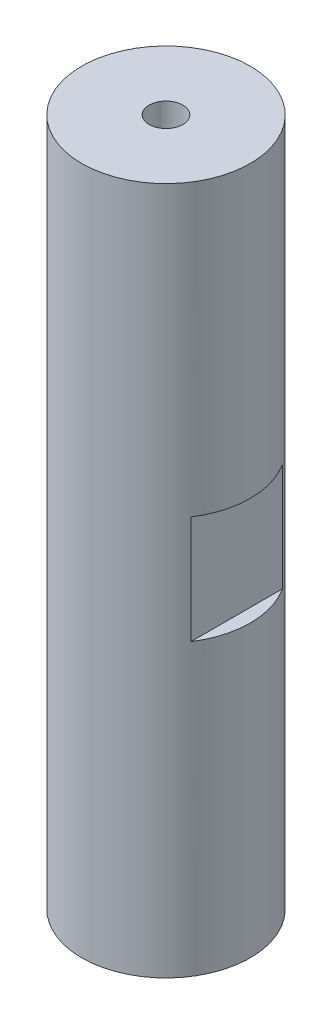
ISO-10303-21;
HEADER;
FILE_DESCRIPTION(('STEP AP214'),'2;1');
FILE_NAME('part.step','',(''),(''),'','','');
FILE_SCHEMA(('AUTOMOTIVE_DESIGN { 1 0 10303 214 1 1 1 1 }'));
ENDSEC;
DATA;
#1=APPLICATION_CONTEXT('core data for automotive mechanical design processes');
#2=APPLICATION_PROTOCOL_DEFINITION('international standard','automotive_design',2000,#1);
#3=PRODUCT_CONTEXT('',#1,'mechanical');
#4=PRODUCT('Part','Part','',(#3));
#5=PRODUCT_RELATED_PRODUCT_CATEGORY('part','',(#4));
#6=PRODUCT_DEFINITION_FORMATION('','',#4);
#7=PRODUCT_DEFINITION_CONTEXT('part definition',#1,'design');
#8=PRODUCT_DEFINITION('design','',#6,#7);
#9=PRODUCT_DEFINITION_SHAPE('','',#8);
#10=(LENGTH_UNIT() NAMED_UNIT(*) SI_UNIT(.MILLI.,.METRE.));
#11=(NAMED_UNIT(*) PLANE_ANGLE_UNIT() SI_UNIT($,.RADIAN.));
#12=(NAMED_UNIT(*) SI_UNIT($,.STERADIAN.) SOLID_ANGLE_UNIT());
#13=UNCERTAINTY_MEASURE_WITH_UNIT(LENGTH_MEASURE(1.E-05),#10,'distance_accuracy_value','');
#14=(GEOMETRIC_REPRESENTATION_CONTEXT(3) GLOBAL_UNCERTAINTY_ASSIGNED_CONTEXT((#13)) GLOBAL_UNIT_ASSIGNED_CONTEXT((#10,
#11,#12)) REPRESENTATION_CONTEXT('',''));
#15=CARTESIAN_POINT('',(0.,0.,0.));
#16=DIRECTION('',(0.,0.,1.));
#17=DIRECTION('',(1.,0.,0.));
#18=AXIS2_PLACEMENT_3D('',#15,#16,#17);
#19=CARTESIAN_POINT('',(0.,86.9999999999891,0.));
#20=DIRECTION('',(0.,1.,0.));
#21=DIRECTION('',(0.,0.,1.));
#22=AXIS2_PLACEMENT_3D('',#19,#20,#21);
#23=CONICAL_SURFACE('',#22,2.49999999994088,1.02974425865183);
#24=CARTESIAN_POINT('',(0.,85.4978484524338,2.8421709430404E-11));
#25=VERTEX_POINT('',#24);
#26=VERTEX_LOOP('',#25);
#27=FACE_BOUND('',#26,.T.);
#28=CARTESIAN_POINT('',(0.,87.,0.));
#29=DIRECTION('',(0.,1.,0.));
#30=DIRECTION('',(0.,0.,1.));
#31=AXIS2_PLACEMENT_3D('',#28,#29,#30);
#32=CIRCLE('',#31,2.5);
#33=CARTESIAN_POINT('',(0.,87.,2.5));
#34=VERTEX_POINT('',#33);
#35=EDGE_CURVE('E106',#34,#34,#32,.T.);
#36=ORIENTED_EDGE('',*,*,#35,.T.);
#37=EDGE_LOOP('',(#36));
#38=FACE_BOUND('',#37,.T.);
#39=ADVANCED_FACE('F17',(#27,#38),#23,.F.);
#40=CARTESIAN_POINT('',(0.,14.9999999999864,0.));
#41=DIRECTION('',(0.,-1.,0.));
#42=DIRECTION('',(0.,0.,-1.));
#43=AXIS2_PLACEMENT_3D('',#40,#41,#42);
#44=CONICAL_SURFACE('',#43,2.49999999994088,1.02974425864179);
#45=CARTESIAN_POINT('',(0.,16.5021515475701,0.));
#46=VERTEX_POINT('',#45);
#47=VERTEX_LOOP('',#46);
#48=FACE_BOUND('',#47,.T.);
#49=CARTESIAN_POINT('',(0.,15.,0.));
#50=DIRECTION('',(0.,-1.,0.));
#51=DIRECTION('',(0.,0.,-1.));
#52=AXIS2_PLACEMENT_3D('',#49,#50,#51);
#53=CIRCLE('',#52,2.49999999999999);
#54=CARTESIAN_POINT('',(0.,15.,-2.49999999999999));
#55=VERTEX_POINT('',#54);
#56=EDGE_CURVE('E67',#55,#55,#53,.T.);
#57=ORIENTED_EDGE('',*,*,#56,.T.);
#58=EDGE_LOOP('',(#57));
#59=FACE_BOUND('',#58,.T.);
#60=ADVANCED_FACE('F223',(#48,#59),#44,.F.);
#61=CARTESIAN_POINT('',(0.,102.,0.));
#62=DIRECTION('',(0.,1.,0.));
#63=DIRECTION('',(0.,0.,1.));
#64=AXIS2_PLACEMENT_3D('',#61,#62,#63);
#65=CYLINDRICAL_SURFACE('',#64,2.5);
#66=CARTESIAN_POINT('',(0.,102.,0.));
#67=DIRECTION('',(0.,1.,0.));
#68=DIRECTION('',(0.,0.,1.));
#69=AXIS2_PLACEMENT_3D('',#66,#67,#68);
#70=CIRCLE('',#69,2.5);
#71=CARTESIAN_POINT('',(0.,102.,2.5));
#72=VERTEX_POINT('',#71);
#73=EDGE_CURVE('E20',#72,#72,#70,.F.);
#74=ORIENTED_EDGE('',*,*,#73,.F.);
#75=EDGE_LOOP('',(#74));
#76=FACE_BOUND('',#75,.T.);
#77=ORIENTED_EDGE('',*,*,#35,.F.);
#78=EDGE_LOOP('',(#77));
#79=FACE_BOUND('',#78,.T.);
#80=ADVANCED_FACE('F213',(#76,#79),#65,.F.);
#81=CARTESIAN_POINT('',(0.,0.,0.));
#82=DIRECTION('',(0.,-1.,0.));
#83=DIRECTION('',(0.,0.,-1.));
#84=AXIS2_PLACEMENT_3D('',#81,#82,#83);
#85=CYLINDRICAL_SURFACE('',#84,2.49999999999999);
#86=ORIENTED_EDGE('',*,*,#56,.F.);
#87=EDGE_LOOP('',(#86));
#88=FACE_BOUND('',#87,.T.);
#89=CARTESIAN_POINT('',(0.,0.,0.));
#90=DIRECTION('',(0.,-1.,0.));
#91=DIRECTION('',(0.,0.,-1.));
#92=AXIS2_PLACEMENT_3D('',#89,#90,#91);
#93=CIRCLE('',#92,2.49999999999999);
#94=CARTESIAN_POINT('',(0.,0.,-2.49999999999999));
#95=VERTEX_POINT('',#94);
#96=EDGE_CURVE('E81',#95,#95,#93,.T.);
#97=ORIENTED_EDGE('',*,*,#96,.T.);
#98=EDGE_LOOP('',(#97));
#99=FACE_BOUND('',#98,.T.);
#100=ADVANCED_FACE('F204',(#88,#99),#85,.F.);
#101=CARTESIAN_POINT('',(-14.5,43.,-12.5));
#102=DIRECTION('',(0.,-1.,0.));
#103=DIRECTION('',(0.,0.,-1.));
#104=AXIS2_PLACEMENT_3D('',#101,#102,#103);
#105=PLANE('',#104);
#106=CARTESIAN_POINT('',(0.,43.,0.));
#107=DIRECTION('',(0.,-1.,0.));
#108=DIRECTION('',(0.,0.,-1.));
#109=AXIS2_PLACEMENT_3D('',#106,#107,#108);
#110=CIRCLE('',#109,12.5);
#111=CARTESIAN_POINT('',(-10.5,43.,6.78232998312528));
#112=VERTEX_POINT('',#111);
#113=CARTESIAN_POINT('',(-10.5,43.,-6.78232998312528));
#114=VERTEX_POINT('',#113);
#115=EDGE_CURVE('E64',#112,#114,#110,.T.);
#116=ORIENTED_EDGE('',*,*,#115,.F.);
#117=DIRECTION('',(0.,0.,1.));
#118=VECTOR('',#117,1.);
#119=CARTESIAN_POINT('',(-10.5,43.,-12.5));
#120=LINE('',#119,#118);
#121=EDGE_CURVE('E59',#112,#114,#120,.F.);
#122=ORIENTED_EDGE('',*,*,#121,.T.);
#123=EDGE_LOOP('',(#116,#122));
#124=FACE_BOUND('',#123,.T.);
#125=ADVANCED_FACE('F62',(#124),#105,.F.);
#126=CARTESIAN_POINT('',(-10.5,43.,-12.5));
#127=DIRECTION('',(1.,0.,0.));
#128=DIRECTION('',(0.,1.,0.));
#129=AXIS2_PLACEMENT_3D('',#126,#127,#128);
#130=PLANE('',#129);
#131=DIRECTION('',(0.,-1.,0.));
#132=VECTOR('',#131,1.);
#133=CARTESIAN_POINT('',(-10.5,102.,-6.78232998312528));
#134=LINE('',#133,#132);
#135=CARTESIAN_POINT('',(-10.5,59.,-6.78232998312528));
#136=VERTEX_POINT('',#135);
#137=EDGE_CURVE('E70',#114,#136,#134,.F.);
#138=ORIENTED_EDGE('',*,*,#137,.F.);
#139=ORIENTED_EDGE('',*,*,#121,.F.);
#140=DIRECTION('',(0.,-1.,0.));
#141=VECTOR('',#140,1.);
#142=CARTESIAN_POINT('',(-10.5,102.,6.78232998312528));
#143=LINE('',#142,#141);
#144=CARTESIAN_POINT('',(-10.5,59.,6.78232998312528));
#145=VERTEX_POINT('',#144);
#146=EDGE_CURVE('E79',#145,#112,#143,.T.);
#147=ORIENTED_EDGE('',*,*,#146,.F.);
#148=DIRECTION('',(0.,0.,1.));
#149=VECTOR('',#148,1.);
#150=CARTESIAN_POINT('',(-10.5,59.,-12.5));
#151=LINE('',#150,#149);
#152=EDGE_CURVE('E66',#145,#136,#151,.F.);
#153=ORIENTED_EDGE('',*,*,#152,.T.);
#154=EDGE_LOOP('',(#138,#139,#147,#153));
#155=FACE_BOUND('',#154,.T.);
#156=ADVANCED_FACE('F71',(#155),#130,.F.);
#157=CARTESIAN_POINT('',(-14.5,59.,-12.5));
#158=DIRECTION('',(0.,1.,0.));
#159=DIRECTION('',(0.,0.,1.));
#160=AXIS2_PLACEMENT_3D('',#157,#158,#159);
#161=PLANE('',#160);
#162=CARTESIAN_POINT('',(0.,59.,0.));
#163=DIRECTION('',(0.,-1.,0.));
#164=DIRECTION('',(0.,0.,-1.));
#165=AXIS2_PLACEMENT_3D('',#162,#163,#164);
#166=CIRCLE('',#165,12.5);
#167=EDGE_CURVE('E76',#136,#145,#166,.F.);
#168=ORIENTED_EDGE('',*,*,#167,.F.);
#169=ORIENTED_EDGE('',*,*,#152,.F.);
#170=EDGE_LOOP('',(#168,#169));
#171=FACE_BOUND('',#170,.T.);
#172=ADVANCED_FACE('F129',(#171),#161,.F.);
#173=CARTESIAN_POINT('',(10.5,43.,-12.5));
#174=DIRECTION('',(0.,-1.,0.));
#175=DIRECTION('',(0.,0.,-1.));
#176=AXIS2_PLACEMENT_3D('',#173,#174,#175);
#177=PLANE('',#176);
#178=CARTESIAN_POINT('',(0.,43.,0.));
#179=DIRECTION('',(0.,-1.,0.));
#180=DIRECTION('',(0.,0.,-1.));
#181=AXIS2_PLACEMENT_3D('',#178,#179,#180);
#182=CIRCLE('',#181,12.5);
#183=CARTESIAN_POINT('',(10.5,43.,-6.78232998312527));
#184=VERTEX_POINT('',#183);
#185=CARTESIAN_POINT('',(10.5,43.,6.78232998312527));
#186=VERTEX_POINT('',#185);
#187=EDGE_CURVE('E99',#184,#186,#182,.T.);
#188=ORIENTED_EDGE('',*,*,#187,.F.);
#189=DIRECTION('',(0.,0.,1.));
#190=VECTOR('',#189,1.);
#191=CARTESIAN_POINT('',(10.5,43.,-12.5));
#192=LINE('',#191,#190);
#193=EDGE_CURVE('E91',#184,#186,#192,.T.);
#194=ORIENTED_EDGE('',*,*,#193,.T.);
#195=EDGE_LOOP('',(#188,#194));
#196=FACE_BOUND('',#195,.T.);
#197=ADVANCED_FACE('F116',(#196),#177,.F.);
#198=CARTESIAN_POINT('',(10.5,43.,-12.5));
#199=DIRECTION('',(-1.,0.,0.));
#200=DIRECTION('',(0.,0.,1.));
#201=AXIS2_PLACEMENT_3D('',#198,#199,#200);
#202=PLANE('',#201);
#203=DIRECTION('',(0.,-1.,0.));
#204=VECTOR('',#203,1.);
#205=CARTESIAN_POINT('',(10.5,102.,6.78232998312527));
#206=LINE('',#205,#204);
#207=CARTESIAN_POINT('',(10.5,59.,6.78232998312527));
#208=VERTEX_POINT('',#207);
#209=EDGE_CURVE('E95',#186,#208,#206,.F.);
#210=ORIENTED_EDGE('',*,*,#209,.F.);
#211=ORIENTED_EDGE('',*,*,#193,.F.);
#212=DIRECTION('',(0.,-1.,0.));
#213=VECTOR('',#212,1.);
#214=CARTESIAN_POINT('',(10.5,102.,-6.78232998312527));
#215=LINE('',#214,#213);
#216=CARTESIAN_POINT('',(10.5,59.,-6.78232998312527));
#217=VERTEX_POINT('',#216);
#218=EDGE_CURVE('E100',#217,#184,#215,.T.);
#219=ORIENTED_EDGE('',*,*,#218,.F.);
#220=DIRECTION('',(0.,0.,1.));
#221=VECTOR('',#220,1.);
#222=CARTESIAN_POINT('',(10.5,59.,-12.5));
#223=LINE('',#222,#221);
#224=EDGE_CURVE('E35',#217,#208,#223,.T.);
#225=ORIENTED_EDGE('',*,*,#224,.T.);
#226=EDGE_LOOP('',(#210,#211,#219,#225));
#227=FACE_BOUND('',#226,.T.);
#228=ADVANCED_FACE('F117',(#227),#202,.F.);
#229=CARTESIAN_POINT('',(10.5,59.,-12.5));
#230=DIRECTION('',(0.,1.,0.));
#231=DIRECTION('',(0.,0.,1.));
#232=AXIS2_PLACEMENT_3D('',#229,#230,#231);
#233=PLANE('',#232);
#234=CARTESIAN_POINT('',(0.,59.,0.));
#235=DIRECTION('',(0.,-1.,0.));
#236=DIRECTION('',(0.,0.,-1.));
#237=AXIS2_PLACEMENT_3D('',#234,#235,#236);
#238=CIRCLE('',#237,12.5);
#239=EDGE_CURVE('E98',#208,#217,#238,.F.);
#240=ORIENTED_EDGE('',*,*,#239,.F.);
#241=ORIENTED_EDGE('',*,*,#224,.F.);
#242=EDGE_LOOP('',(#240,#241));
#243=FACE_BOUND('',#242,.T.);
#244=ADVANCED_FACE('F119',(#243),#233,.F.);
#245=CARTESIAN_POINT('',(0.,102.,0.));
#246=DIRECTION('',(0.,1.,0.));
#247=DIRECTION('',(0.,0.,1.));
#248=AXIS2_PLACEMENT_3D('',#245,#246,#247);
#249=PLANE('',#248);
#250=CARTESIAN_POINT('',(0.,102.,0.));
#251=DIRECTION('',(0.,-1.,0.));
#252=DIRECTION('',(0.,0.,-1.));
#253=AXIS2_PLACEMENT_3D('',#250,#251,#252);
#254=CIRCLE('',#253,12.5);
#255=CARTESIAN_POINT('',(0.,102.,-12.5));
#256=VERTEX_POINT('',#255);
#257=EDGE_CURVE('E26',#256,#256,#254,.T.);
#258=ORIENTED_EDGE('',*,*,#257,.F.);
#259=EDGE_LOOP('',(#258));
#260=FACE_BOUND('',#259,.T.);
#261=ORIENTED_EDGE('',*,*,#73,.T.);
#262=EDGE_LOOP('',(#261));
#263=FACE_BOUND('',#262,.T.);
#264=ADVANCED_FACE('F126',(#260,#263),#249,.T.);
#265=CARTESIAN_POINT('',(0.,0.,0.));
#266=DIRECTION('',(0.,1.,0.));
#267=DIRECTION('',(0.,0.,1.));
#268=AXIS2_PLACEMENT_3D('',#265,#266,#267);
#269=PLANE('',#268);
#270=CARTESIAN_POINT('',(0.,0.,0.));
#271=DIRECTION('',(0.,-1.,0.));
#272=DIRECTION('',(0.,0.,-1.));
#273=AXIS2_PLACEMENT_3D('',#270,#271,#272);
#274=CIRCLE('',#273,12.5);
#275=CARTESIAN_POINT('',(0.,0.,-12.5));
#276=VERTEX_POINT('',#275);
#277=EDGE_CURVE('E11',#276,#276,#274,.F.);
#278=ORIENTED_EDGE('',*,*,#277,.F.);
#279=EDGE_LOOP('',(#278));
#280=FACE_BOUND('',#279,.T.);
#281=ORIENTED_EDGE('',*,*,#96,.F.);
#282=EDGE_LOOP('',(#281));
#283=FACE_BOUND('',#282,.T.);
#284=ADVANCED_FACE('F132',(#280,#283),#269,.F.);
#285=CARTESIAN_POINT('',(0.,102.,0.));
#286=DIRECTION('',(0.,-1.,0.));
#287=DIRECTION('',(0.,0.,-1.));
#288=AXIS2_PLACEMENT_3D('',#285,#286,#287);
#289=CYLINDRICAL_SURFACE('',#288,12.5);
#290=ORIENTED_EDGE('',*,*,#277,.T.);
#291=EDGE_LOOP('',(#290));
#292=FACE_BOUND('',#291,.T.);
#293=ORIENTED_EDGE('',*,*,#257,.T.);
#294=EDGE_LOOP('',(#293));
#295=FACE_BOUND('',#294,.T.);
#296=ORIENTED_EDGE('',*,*,#209,.T.);
#297=ORIENTED_EDGE('',*,*,#239,.T.);
#298=ORIENTED_EDGE('',*,*,#218,.T.);
#299=ORIENTED_EDGE('',*,*,#187,.T.);
#300=EDGE_LOOP('',(#296,#297,#298,#299));
#301=FACE_BOUND('',#300,.T.);
#302=ORIENTED_EDGE('',*,*,#137,.T.);
#303=ORIENTED_EDGE('',*,*,#167,.T.);
#304=ORIENTED_EDGE('',*,*,#146,.T.);
#305=ORIENTED_EDGE('',*,*,#115,.T.);
#306=EDGE_LOOP('',(#302,#303,#304,#305));
#307=FACE_BOUND('',#306,.T.);
#308=ADVANCED_FACE('F78',(#292,#295,#301,#307),#289,.T.);
#309=CLOSED_SHELL('',(#39,#60,#80,#100,#125,#156,#172,#197,#228,#244,#264,#284,#308));
#310=MANIFOLD_SOLID_BREP('B1',#309);
#311=ADVANCED_BREP_SHAPE_REPRESENTATION('',(#18,#310),#14);
#312=SHAPE_DEFINITION_REPRESENTATION(#9,#311);
ENDSEC;
END-ISO-10303-21;
